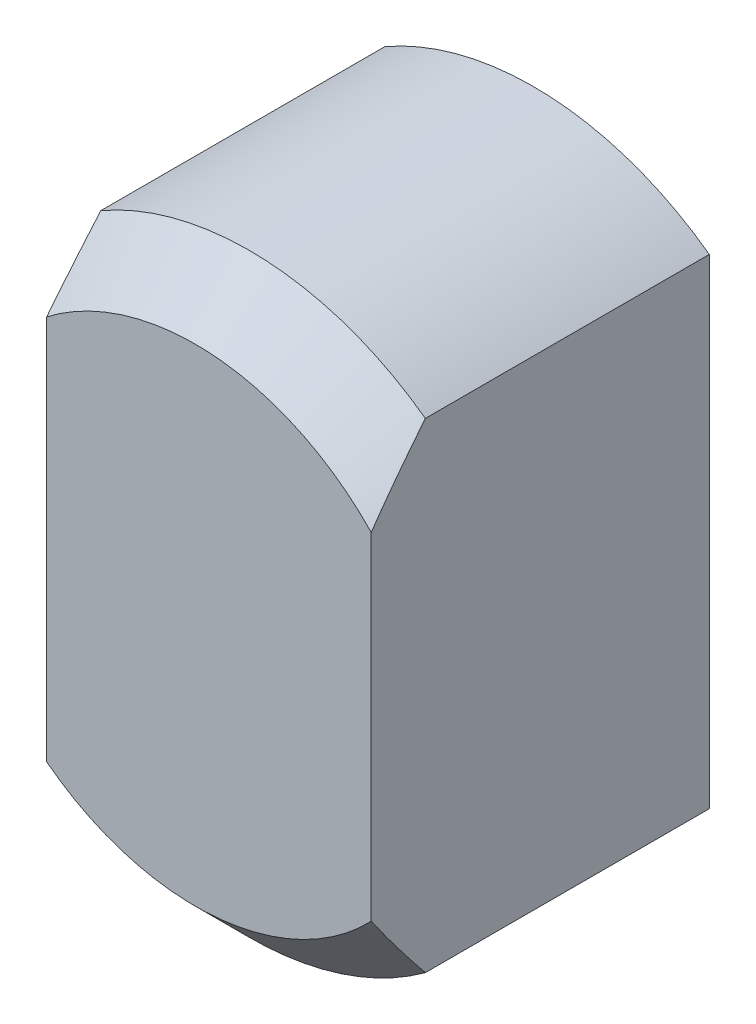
from build123d import *

# Parameters (mm, degrees)
BOSS_EXTRUDE1_DEPTH = 158.75
CHAMFER1_SIZE       = 25.4


with BuildPart() as part:
    # Sketch1 → Boss-Extrude1 (new body)
    with BuildSketch(Plane.XY):
        with BuildLine():
            Line((-69.85, 120.983748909), (-69.85, -120.983748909))
            ThreePointArc((-69.85, -120.983748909), (7.581039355, -139.49414985), (82.55, -112.701319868))
            Line((82.55, -112.701319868), (82.55, 112.701319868))
            ThreePointArc((82.55, 112.701319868), (7.581039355, 139.49414985), (-69.85, 120.983748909))
        make_face()
    extrude(amount=BOSS_EXTRUDE1_DEPTH)

    # Chamfer1
    chamfer1_edges = [part.edges().sort_by_distance(p)[0] for p in [
        (7.581039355, 139.49414985, 158.75),
        (7.581039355, -139.49414985, 158.75),
    ]]
    chamfer(chamfer1_edges, length=CHAMFER1_SIZE)


solid = part.part
